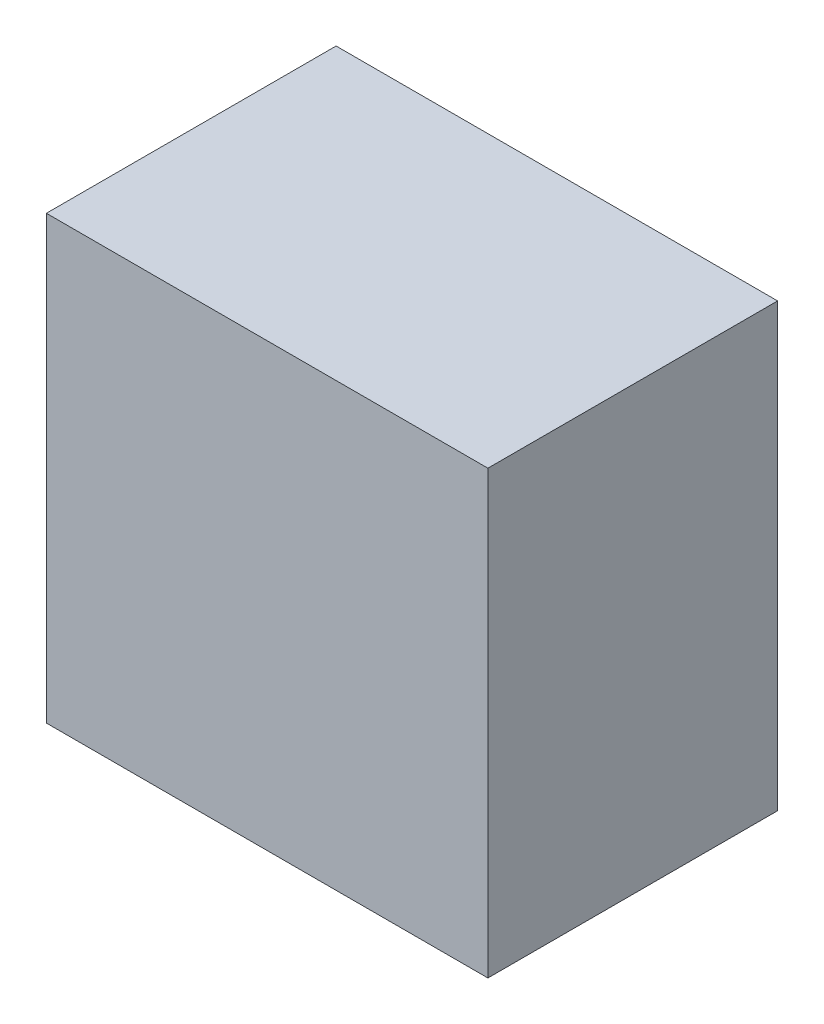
ISO-10303-21;
HEADER;
FILE_DESCRIPTION(('STEP AP214'),'2;1');
FILE_NAME('part.step','',(''),(''),'','','');
FILE_SCHEMA(('AUTOMOTIVE_DESIGN { 1 0 10303 214 1 1 1 1 }'));
ENDSEC;
DATA;
#1=APPLICATION_CONTEXT('core data for automotive mechanical design processes');
#2=APPLICATION_PROTOCOL_DEFINITION('international standard','automotive_design',2000,#1);
#3=PRODUCT_CONTEXT('',#1,'mechanical');
#4=PRODUCT('Part','Part','',(#3));
#5=PRODUCT_RELATED_PRODUCT_CATEGORY('part','',(#4));
#6=PRODUCT_DEFINITION_FORMATION('','',#4);
#7=PRODUCT_DEFINITION_CONTEXT('part definition',#1,'design');
#8=PRODUCT_DEFINITION('design','',#6,#7);
#9=PRODUCT_DEFINITION_SHAPE('','',#8);
#10=(LENGTH_UNIT() NAMED_UNIT(*) SI_UNIT(.MILLI.,.METRE.));
#11=(NAMED_UNIT(*) PLANE_ANGLE_UNIT() SI_UNIT($,.RADIAN.));
#12=(NAMED_UNIT(*) SI_UNIT($,.STERADIAN.) SOLID_ANGLE_UNIT());
#13=UNCERTAINTY_MEASURE_WITH_UNIT(LENGTH_MEASURE(1.E-05),#10,'distance_accuracy_value','');
#14=(GEOMETRIC_REPRESENTATION_CONTEXT(3) GLOBAL_UNCERTAINTY_ASSIGNED_CONTEXT((#13)) GLOBAL_UNIT_ASSIGNED_CONTEXT((#10,
#11,#12)) REPRESENTATION_CONTEXT('',''));
#15=CARTESIAN_POINT('',(0.,0.,0.));
#16=DIRECTION('',(0.,0.,1.));
#17=DIRECTION('',(1.,0.,0.));
#18=AXIS2_PLACEMENT_3D('',#15,#16,#17);
#19=CARTESIAN_POINT('',(0.,0.,0.499999));
#20=DIRECTION('',(0.,0.,1.));
#21=DIRECTION('',(1.,0.,0.));
#22=AXIS2_PLACEMENT_3D('',#19,#20,#21);
#23=PLANE('',#22);
#24=DIRECTION('',(1.,0.,0.));
#25=VECTOR('',#24,1.);
#26=CARTESIAN_POINT('',(-0.381,-0.381,0.499999));
#27=LINE('',#26,#25);
#28=CARTESIAN_POINT('',(-0.381,-0.381,0.499999));
#29=VERTEX_POINT('',#28);
#30=CARTESIAN_POINT('',(0.381,-0.381,0.499999));
#31=VERTEX_POINT('',#30);
#32=EDGE_CURVE('E83',#29,#31,#27,.T.);
#33=ORIENTED_EDGE('',*,*,#32,.T.);
#34=DIRECTION('',(0.,1.,0.));
#35=VECTOR('',#34,1.);
#36=CARTESIAN_POINT('',(0.381,-0.381,0.499999));
#37=LINE('',#36,#35);
#38=CARTESIAN_POINT('',(0.381,0.381,0.499999));
#39=VERTEX_POINT('',#38);
#40=EDGE_CURVE('E106',#31,#39,#37,.T.);
#41=ORIENTED_EDGE('',*,*,#40,.T.);
#42=DIRECTION('',(-1.,0.,0.));
#43=VECTOR('',#42,1.);
#44=CARTESIAN_POINT('',(0.381,0.381,0.499999));
#45=LINE('',#44,#43);
#46=CARTESIAN_POINT('',(-0.381,0.381,0.499999));
#47=VERTEX_POINT('',#46);
#48=EDGE_CURVE('E75',#39,#47,#45,.T.);
#49=ORIENTED_EDGE('',*,*,#48,.T.);
#50=DIRECTION('',(0.,-1.,0.));
#51=VECTOR('',#50,1.);
#52=CARTESIAN_POINT('',(-0.381,0.381,0.499999));
#53=LINE('',#52,#51);
#54=EDGE_CURVE('E11',#47,#29,#53,.T.);
#55=ORIENTED_EDGE('',*,*,#54,.T.);
#56=EDGE_LOOP('',(#33,#41,#49,#55));
#57=FACE_BOUND('',#56,.T.);
#58=ADVANCED_FACE('F17',(#57),#23,.T.);
#59=CARTESIAN_POINT('',(0.,0.,0.));
#60=DIRECTION('',(0.,0.,1.));
#61=DIRECTION('',(1.,0.,0.));
#62=AXIS2_PLACEMENT_3D('',#59,#60,#61);
#63=PLANE('',#62);
#64=DIRECTION('',(0.,-1.,0.));
#65=VECTOR('',#64,1.);
#66=CARTESIAN_POINT('',(-0.381,0.381,0.));
#67=LINE('',#66,#65);
#68=CARTESIAN_POINT('',(-0.381,0.381,0.));
#69=VERTEX_POINT('',#68);
#70=CARTESIAN_POINT('',(-0.381,-0.381,0.));
#71=VERTEX_POINT('',#70);
#72=EDGE_CURVE('E26',#69,#71,#67,.T.);
#73=ORIENTED_EDGE('',*,*,#72,.F.);
#74=DIRECTION('',(-1.,0.,0.));
#75=VECTOR('',#74,1.);
#76=CARTESIAN_POINT('',(0.381,0.381,0.));
#77=LINE('',#76,#75);
#78=CARTESIAN_POINT('',(0.381,0.381,0.));
#79=VERTEX_POINT('',#78);
#80=EDGE_CURVE('E110',#79,#69,#77,.T.);
#81=ORIENTED_EDGE('',*,*,#80,.F.);
#82=DIRECTION('',(0.,1.,0.));
#83=VECTOR('',#82,1.);
#84=CARTESIAN_POINT('',(0.381,-0.381,0.));
#85=LINE('',#84,#83);
#86=CARTESIAN_POINT('',(0.381,-0.381,0.));
#87=VERTEX_POINT('',#86);
#88=EDGE_CURVE('E85',#87,#79,#85,.T.);
#89=ORIENTED_EDGE('',*,*,#88,.F.);
#90=DIRECTION('',(1.,0.,0.));
#91=VECTOR('',#90,1.);
#92=CARTESIAN_POINT('',(-0.381,-0.381,0.));
#93=LINE('',#92,#91);
#94=EDGE_CURVE('E81',#71,#87,#93,.T.);
#95=ORIENTED_EDGE('',*,*,#94,.F.);
#96=EDGE_LOOP('',(#73,#81,#89,#95));
#97=FACE_BOUND('',#96,.T.);
#98=ADVANCED_FACE('F19',(#97),#63,.F.);
#99=CARTESIAN_POINT('',(-0.381,0.381,0.));
#100=DIRECTION('',(1.,0.,0.));
#101=DIRECTION('',(0.,1.,0.));
#102=AXIS2_PLACEMENT_3D('',#99,#100,#101);
#103=PLANE('',#102);
#104=ORIENTED_EDGE('',*,*,#72,.T.);
#105=DIRECTION('',(0.,0.,1.));
#106=VECTOR('',#105,1.);
#107=CARTESIAN_POINT('',(-0.381,-0.381,0.));
#108=LINE('',#107,#106);
#109=EDGE_CURVE('E69',#71,#29,#108,.T.);
#110=ORIENTED_EDGE('',*,*,#109,.T.);
#111=ORIENTED_EDGE('',*,*,#54,.F.);
#112=DIRECTION('',(0.,0.,1.));
#113=VECTOR('',#112,1.);
#114=CARTESIAN_POINT('',(-0.381,0.381,0.));
#115=LINE('',#114,#113);
#116=EDGE_CURVE('E72',#69,#47,#115,.T.);
#117=ORIENTED_EDGE('',*,*,#116,.F.);
#118=EDGE_LOOP('',(#104,#110,#111,#117));
#119=FACE_BOUND('',#118,.T.);
#120=ADVANCED_FACE('F68',(#119),#103,.F.);
#121=CARTESIAN_POINT('',(0.381,0.381,0.));
#122=DIRECTION('',(0.,-1.,0.));
#123=DIRECTION('',(0.,0.,-1.));
#124=AXIS2_PLACEMENT_3D('',#121,#122,#123);
#125=PLANE('',#124);
#126=ORIENTED_EDGE('',*,*,#80,.T.);
#127=ORIENTED_EDGE('',*,*,#116,.T.);
#128=ORIENTED_EDGE('',*,*,#48,.F.);
#129=DIRECTION('',(0.,0.,1.));
#130=VECTOR('',#129,1.);
#131=CARTESIAN_POINT('',(0.381,0.381,0.));
#132=LINE('',#131,#130);
#133=EDGE_CURVE('E99',#79,#39,#132,.T.);
#134=ORIENTED_EDGE('',*,*,#133,.F.);
#135=EDGE_LOOP('',(#126,#127,#128,#134));
#136=FACE_BOUND('',#135,.T.);
#137=ADVANCED_FACE('F118',(#136),#125,.F.);
#138=CARTESIAN_POINT('',(0.381,-0.381,0.));
#139=DIRECTION('',(-1.,0.,0.));
#140=DIRECTION('',(0.,0.,1.));
#141=AXIS2_PLACEMENT_3D('',#138,#139,#140);
#142=PLANE('',#141);
#143=ORIENTED_EDGE('',*,*,#88,.T.);
#144=ORIENTED_EDGE('',*,*,#133,.T.);
#145=ORIENTED_EDGE('',*,*,#40,.F.);
#146=DIRECTION('',(0.,0.,1.));
#147=VECTOR('',#146,1.);
#148=CARTESIAN_POINT('',(0.381,-0.381,0.));
#149=LINE('',#148,#147);
#150=EDGE_CURVE('E90',#87,#31,#149,.T.);
#151=ORIENTED_EDGE('',*,*,#150,.F.);
#152=EDGE_LOOP('',(#143,#144,#145,#151));
#153=FACE_BOUND('',#152,.T.);
#154=ADVANCED_FACE('F121',(#153),#142,.F.);
#155=CARTESIAN_POINT('',(-0.381,-0.381,0.));
#156=DIRECTION('',(0.,1.,0.));
#157=DIRECTION('',(1.,0.,0.));
#158=AXIS2_PLACEMENT_3D('',#155,#156,#157);
#159=PLANE('',#158);
#160=ORIENTED_EDGE('',*,*,#94,.T.);
#161=ORIENTED_EDGE('',*,*,#150,.T.);
#162=ORIENTED_EDGE('',*,*,#32,.F.);
#163=ORIENTED_EDGE('',*,*,#109,.F.);
#164=EDGE_LOOP('',(#160,#161,#162,#163));
#165=FACE_BOUND('',#164,.T.);
#166=ADVANCED_FACE('F79',(#165),#159,.F.);
#167=CLOSED_SHELL('',(#58,#98,#120,#137,#154,#166));
#168=MANIFOLD_SOLID_BREP('B1',#167);
#169=ADVANCED_BREP_SHAPE_REPRESENTATION('',(#18,#168),#14);
#170=SHAPE_DEFINITION_REPRESENTATION(#9,#169);
ENDSEC;
END-ISO-10303-21;
